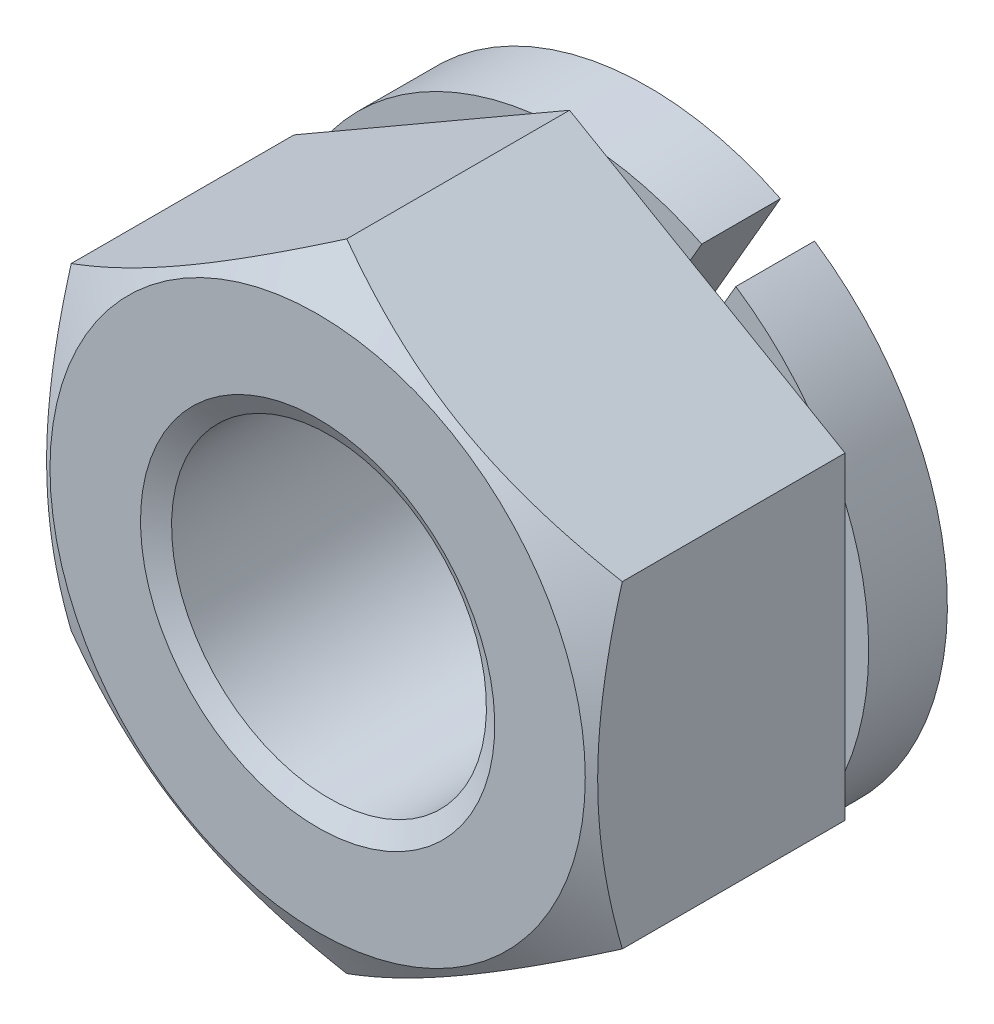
ISO-10303-21;
HEADER;
FILE_DESCRIPTION(('STEP AP214'),'2;1');
FILE_NAME('part.step','',(''),(''),'','','');
FILE_SCHEMA(('AUTOMOTIVE_DESIGN { 1 0 10303 214 1 1 1 1 }'));
ENDSEC;
DATA;
#1=APPLICATION_CONTEXT('core data for automotive mechanical design processes');
#2=APPLICATION_PROTOCOL_DEFINITION('international standard','automotive_design',2000,#1);
#3=PRODUCT_CONTEXT('',#1,'mechanical');
#4=PRODUCT('Part','Part','',(#3));
#5=PRODUCT_RELATED_PRODUCT_CATEGORY('part','',(#4));
#6=PRODUCT_DEFINITION_FORMATION('','',#4);
#7=PRODUCT_DEFINITION_CONTEXT('part definition',#1,'design');
#8=PRODUCT_DEFINITION('design','',#6,#7);
#9=PRODUCT_DEFINITION_SHAPE('','',#8);
#10=(LENGTH_UNIT() NAMED_UNIT(*) SI_UNIT(.MILLI.,.METRE.));
#11=(NAMED_UNIT(*) PLANE_ANGLE_UNIT() SI_UNIT($,.RADIAN.));
#12=(NAMED_UNIT(*) SI_UNIT($,.STERADIAN.) SOLID_ANGLE_UNIT());
#13=UNCERTAINTY_MEASURE_WITH_UNIT(LENGTH_MEASURE(1.E-05),#10,'distance_accuracy_value','');
#14=(GEOMETRIC_REPRESENTATION_CONTEXT(3) GLOBAL_UNCERTAINTY_ASSIGNED_CONTEXT((#13)) GLOBAL_UNIT_ASSIGNED_CONTEXT((#10,
#11,#12)) REPRESENTATION_CONTEXT('',''));
#15=CARTESIAN_POINT('',(0.,0.,0.));
#16=DIRECTION('',(0.,0.,1.));
#17=DIRECTION('',(1.,0.,0.));
#18=AXIS2_PLACEMENT_3D('',#15,#16,#17);
#19=CARTESIAN_POINT('',(7.,0.,1.));
#20=DIRECTION('',(0.,0.,1.));
#21=DIRECTION('',(-0.866025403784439,0.5,0.));
#22=AXIS2_PLACEMENT_3D('',#19,#20,#21);
#23=PLANE('',#22);
#24=CARTESIAN_POINT('',(0.,0.,1.));
#25=DIRECTION('',(0.,0.,-1.));
#26=DIRECTION('',(-0.866025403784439,0.5,0.));
#27=AXIS2_PLACEMENT_3D('',#24,#25,#26);
#28=CIRCLE('',#27,3.8);
#29=CARTESIAN_POINT('',(3.03160056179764,2.2911564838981,1.));
#30=VERTEX_POINT('',#29);
#31=CARTESIAN_POINT('',(3.5,1.47986485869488,1.));
#32=VERTEX_POINT('',#31);
#33=EDGE_CURVE('E9',#30,#32,#28,.T.);
#34=ORIENTED_EDGE('',*,*,#33,.F.);
#35=DIRECTION('',(-0.866025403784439,0.5,0.));
#36=VECTOR('',#35,1.);
#37=CARTESIAN_POINT('',(3.5,2.02072594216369,1.));
#38=LINE('',#37,#36);
#39=CARTESIAN_POINT('',(3.5,2.02072594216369,1.));
#40=VERTEX_POINT('',#39);
#41=EDGE_CURVE('E344',#40,#30,#38,.T.);
#42=ORIENTED_EDGE('',*,*,#41,.F.);
#43=DIRECTION('',(0.,1.,0.));
#44=VECTOR('',#43,1.);
#45=CARTESIAN_POINT('',(3.5,-2.02072594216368,1.));
#46=LINE('',#45,#44);
#47=EDGE_CURVE('E339',#32,#40,#46,.T.);
#48=ORIENTED_EDGE('',*,*,#47,.F.);
#49=EDGE_LOOP('',(#34,#42,#48));
#50=FACE_BOUND('',#49,.T.);
#51=ADVANCED_FACE('F14',(#50),#23,.F.);
#52=CARTESIAN_POINT('',(3.5,-1.47986485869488,1.));
#53=VERTEX_POINT('',#52);
#54=CARTESIAN_POINT('',(3.03160056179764,-2.29115648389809,1.));
#55=VERTEX_POINT('',#54);
#56=EDGE_CURVE('E24',#53,#55,#28,.T.);
#57=ORIENTED_EDGE('',*,*,#56,.F.);
#58=CARTESIAN_POINT('',(3.5,-2.02072594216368,1.));
#59=VERTEX_POINT('',#58);
#60=EDGE_CURVE('E341',#59,#53,#46,.T.);
#61=ORIENTED_EDGE('',*,*,#60,.F.);
#62=DIRECTION('',(0.866025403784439,0.5,0.));
#63=VECTOR('',#62,1.);
#64=CARTESIAN_POINT('',(0.,-4.04145188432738,1.));
#65=LINE('',#64,#63);
#66=EDGE_CURVE('E333',#55,#59,#65,.T.);
#67=ORIENTED_EDGE('',*,*,#66,.F.);
#68=EDGE_LOOP('',(#57,#61,#67));
#69=FACE_BOUND('',#68,.T.);
#70=ADVANCED_FACE('F291',(#69),#23,.F.);
#71=CARTESIAN_POINT('',(0.468399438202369,-3.77102134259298,1.));
#72=VERTEX_POINT('',#71);
#73=CARTESIAN_POINT('',(-0.468399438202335,-3.77102134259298,1.));
#74=VERTEX_POINT('',#73);
#75=EDGE_CURVE('E434',#72,#74,#28,.T.);
#76=ORIENTED_EDGE('',*,*,#75,.F.);
#77=CARTESIAN_POINT('',(0.,-4.04145188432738,1.));
#78=VERTEX_POINT('',#77);
#79=EDGE_CURVE('E336',#78,#72,#65,.T.);
#80=ORIENTED_EDGE('',*,*,#79,.F.);
#81=DIRECTION('',(0.86602540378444,-0.5,0.));
#82=VECTOR('',#81,1.);
#83=CARTESIAN_POINT('',(-3.5,-2.02072594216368,1.));
#84=LINE('',#83,#82);
#85=EDGE_CURVE('E357',#74,#78,#84,.T.);
#86=ORIENTED_EDGE('',*,*,#85,.F.);
#87=EDGE_LOOP('',(#76,#80,#86));
#88=FACE_BOUND('',#87,.T.);
#89=ADVANCED_FACE('F418',(#88),#23,.F.);
#90=CARTESIAN_POINT('',(-3.03160056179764,-2.29115648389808,1.));
#91=VERTEX_POINT('',#90);
#92=CARTESIAN_POINT('',(-3.5,-1.4798648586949,1.));
#93=VERTEX_POINT('',#92);
#94=EDGE_CURVE('E438',#91,#93,#28,.T.);
#95=ORIENTED_EDGE('',*,*,#94,.F.);
#96=CARTESIAN_POINT('',(-3.5,-2.02072594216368,1.));
#97=VERTEX_POINT('',#96);
#98=EDGE_CURVE('E359',#97,#91,#84,.T.);
#99=ORIENTED_EDGE('',*,*,#98,.F.);
#100=DIRECTION('',(0.,-1.,0.));
#101=VECTOR('',#100,1.);
#102=CARTESIAN_POINT('',(-3.5,2.02072594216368,1.));
#103=LINE('',#102,#101);
#104=EDGE_CURVE('E352',#93,#97,#103,.T.);
#105=ORIENTED_EDGE('',*,*,#104,.F.);
#106=EDGE_LOOP('',(#95,#99,#105));
#107=FACE_BOUND('',#106,.T.);
#108=ADVANCED_FACE('F423',(#107),#23,.F.);
#109=CARTESIAN_POINT('',(-3.5,1.47986485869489,1.));
#110=VERTEX_POINT('',#109);
#111=CARTESIAN_POINT('',(-3.03160056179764,2.29115648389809,1.));
#112=VERTEX_POINT('',#111);
#113=EDGE_CURVE('E450',#110,#112,#28,.T.);
#114=ORIENTED_EDGE('',*,*,#113,.F.);
#115=CARTESIAN_POINT('',(-3.5,2.02072594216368,1.));
#116=VERTEX_POINT('',#115);
#117=EDGE_CURVE('E354',#116,#110,#103,.T.);
#118=ORIENTED_EDGE('',*,*,#117,.F.);
#119=DIRECTION('',(-0.866025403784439,-0.5,0.));
#120=VECTOR('',#119,1.);
#121=CARTESIAN_POINT('',(0.,4.04145188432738,1.));
#122=LINE('',#121,#120);
#123=EDGE_CURVE('E347',#112,#116,#122,.T.);
#124=ORIENTED_EDGE('',*,*,#123,.F.);
#125=EDGE_LOOP('',(#114,#118,#124));
#126=FACE_BOUND('',#125,.T.);
#127=ADVANCED_FACE('F429',(#126),#23,.F.);
#128=CARTESIAN_POINT('',(-0.468399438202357,3.77102134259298,1.));
#129=VERTEX_POINT('',#128);
#130=CARTESIAN_POINT('',(0.468399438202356,3.77102134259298,1.));
#131=VERTEX_POINT('',#130);
#132=EDGE_CURVE('E152',#129,#131,#28,.T.);
#133=ORIENTED_EDGE('',*,*,#132,.F.);
#134=CARTESIAN_POINT('',(0.,4.04145188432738,1.));
#135=VERTEX_POINT('',#134);
#136=EDGE_CURVE('E349',#135,#129,#122,.T.);
#137=ORIENTED_EDGE('',*,*,#136,.F.);
#138=EDGE_CURVE('E343',#131,#135,#38,.T.);
#139=ORIENTED_EDGE('',*,*,#138,.F.);
#140=EDGE_LOOP('',(#133,#137,#139));
#141=FACE_BOUND('',#140,.T.);
#142=ADVANCED_FACE('F458',(#141),#23,.F.);
#143=DIRECTION('',(0.5,0.866025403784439,0.));
#144=VECTOR('',#143,1.);
#145=CARTESIAN_POINT('',(1.2338558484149,1.63710101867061,1.));
#146=LINE('',#145,#144);
#147=CARTESIAN_POINT('',(1.334540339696,1.81149167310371,1.));
#148=VERTEX_POINT('',#147);
#149=CARTESIAN_POINT('',(1.96650635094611,2.90608891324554,1.));
#150=VERTEX_POINT('',#149);
#151=EDGE_CURVE('E317',#148,#150,#146,.T.);
#152=ORIENTED_EDGE('',*,*,#151,.F.);
#153=CARTESIAN_POINT('',(0.,0.,1.));
#154=DIRECTION('',(0.,0.,1.));
#155=DIRECTION('',(-0.866025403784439,0.5,0.));
#156=AXIS2_PLACEMENT_3D('',#153,#154,#155);
#157=CIRCLE('',#156,2.25);
#158=CARTESIAN_POINT('',(0.901527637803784,2.06149167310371,1.));
#159=VERTEX_POINT('',#158);
#160=EDGE_CURVE('E328',#148,#159,#157,.T.);
#161=ORIENTED_EDGE('',*,*,#160,.T.);
#162=DIRECTION('',(-0.5,-0.866025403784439,0.));
#163=VECTOR('',#162,1.);
#164=CARTESIAN_POINT('',(0.800843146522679,1.88710101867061,1.));
#165=LINE('',#164,#163);
#166=CARTESIAN_POINT('',(1.53349364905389,3.15608891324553,1.));
#167=VERTEX_POINT('',#166);
#168=EDGE_CURVE('E168',#167,#159,#165,.T.);
#169=ORIENTED_EDGE('',*,*,#168,.F.);
#170=EDGE_CURVE('E483',#150,#167,#38,.T.);
#171=ORIENTED_EDGE('',*,*,#170,.F.);
#172=EDGE_LOOP('',(#152,#161,#169,#171));
#173=FACE_BOUND('',#172,.T.);
#174=ADVANCED_FACE('F255',(#173),#23,.F.);
#175=CARTESIAN_POINT('',(0.,-4.04145188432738,4.2));
#176=DIRECTION('',(-0.5,0.866025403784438,0.));
#177=DIRECTION('',(-0.866025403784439,-0.5,0.));
#178=AXIS2_PLACEMENT_3D('',#175,#176,#177);
#179=PLANE('',#178);
#180=CARTESIAN_POINT('',(-0.000199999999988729,-4.04156735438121,3.82959091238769));
#181=CARTESIAN_POINT('',(0.153607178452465,-3.95276673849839,3.88087918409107));
#182=CARTESIAN_POINT('',(0.30874201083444,-3.86319960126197,3.92752401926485));
#183=CARTESIAN_POINT('',(0.621698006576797,-3.68251437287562,4.00894309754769));
#184=CARTESIAN_POINT('',(0.77952473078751,-3.59139307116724,4.04368853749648));
#185=CARTESIAN_POINT('',(1.09322221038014,-3.41027974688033,4.0977749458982));
#186=CARTESIAN_POINT('',(1.24904469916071,-3.32031559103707,4.11747588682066));
#187=CARTESIAN_POINT('',(1.56142288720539,-3.13996396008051,4.14099484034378));
#188=CARTESIAN_POINT('',(1.71797745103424,-3.04957714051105,4.14483232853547));
#189=CARTESIAN_POINT('',(2.010509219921,-2.88068384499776,4.13684967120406));
#190=CARTESIAN_POINT('',(2.14653021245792,-2.80215208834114,4.12698953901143));
#191=CARTESIAN_POINT('',(2.41768602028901,-2.64560020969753,4.09573850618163));
#192=CARTESIAN_POINT('',(2.55281989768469,-2.56758062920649,4.07433692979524));
#193=CARTESIAN_POINT('',(2.82453479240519,-2.41070596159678,4.02083456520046));
#194=CARTESIAN_POINT('',(2.96108141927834,-2.33187072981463,3.98850697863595));
#195=CARTESIAN_POINT('',(3.2321380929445,-2.17537608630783,3.91513603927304));
#196=CARTESIAN_POINT('',(3.36665161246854,-2.09771466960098,3.87410992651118));
#197=CARTESIAN_POINT('',(3.5002,-2.02061047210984,3.82959091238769));
#198=B_SPLINE_CURVE_WITH_KNOTS('',3,(#180,#181,#182,#183,#184,#185,#186,#187,#188,#189,#190,
#191,#192,#193,#194,#195,#196,#197),.UNSPECIFIED.,.F.,.F.,(4,2,2,2,2,2,2,2,4),(0.,
0.554793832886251,1.11092123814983,1.65328467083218,2.19498204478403,2.66665130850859,
3.13875761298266,3.62133612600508,4.10296698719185),.UNSPECIFIED.);
#199=CARTESIAN_POINT('',(1.30212680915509E-13,-4.04145188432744,3.82965758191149));
#200=VERTEX_POINT('',#199);
#201=CARTESIAN_POINT('',(3.5,-2.02072594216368,3.82965758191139));
#202=VERTEX_POINT('',#201);
#203=EDGE_CURVE('E239',#200,#202,#198,.T.);
#204=ORIENTED_EDGE('',*,*,#203,.F.);
#205=DIRECTION('',(0.,0.,-1.));
#206=VECTOR('',#205,1.);
#207=CARTESIAN_POINT('',(0.,-4.04145188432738,4.2));
#208=LINE('',#207,#206);
#209=EDGE_CURVE('E362',#200,#78,#208,.T.);
#210=ORIENTED_EDGE('',*,*,#209,.T.);
#211=ORIENTED_EDGE('',*,*,#79,.T.);
#212=EDGE_CURVE('E340',#72,#55,#65,.T.);
#213=ORIENTED_EDGE('',*,*,#212,.T.);
#214=ORIENTED_EDGE('',*,*,#66,.T.);
#215=DIRECTION('',(0.,0.,-1.));
#216=VECTOR('',#215,1.);
#217=CARTESIAN_POINT('',(3.5,-2.02072594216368,4.2));
#218=LINE('',#217,#216);
#219=EDGE_CURVE('E377',#202,#59,#218,.T.);
#220=ORIENTED_EDGE('',*,*,#219,.F.);
#221=EDGE_LOOP('',(#204,#210,#211,#213,#214,#220));
#222=FACE_BOUND('',#221,.T.);
#223=ADVANCED_FACE('F16',(#222),#179,.F.);
#224=CARTESIAN_POINT('',(3.5,-2.02072594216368,4.2));
#225=DIRECTION('',(-1.,0.,0.));
#226=DIRECTION('',(0.,-1.,0.));
#227=AXIS2_PLACEMENT_3D('',#224,#225,#226);
#228=PLANE('',#227);
#229=CARTESIAN_POINT('',(3.5,-2.02095688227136,3.82959091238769));
#230=CARTESIAN_POINT('',(3.5,-1.84335565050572,3.88087918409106));
#231=CARTESIAN_POINT('',(3.5,-1.66422137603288,3.92752401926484));
#232=CARTESIAN_POINT('',(3.5,-1.30285091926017,4.00894309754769));
#233=CARTESIAN_POINT('',(3.5,-1.12060831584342,4.04368853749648));
#234=CARTESIAN_POINT('',(3.5,-0.758381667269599,4.0977749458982));
#235=CARTESIAN_POINT('',(3.5,-0.578453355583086,4.11747588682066));
#236=CARTESIAN_POINT('',(3.5,-0.217750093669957,4.14099484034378));
#237=CARTESIAN_POINT('',(3.5,-0.0369764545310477,4.14483232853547));
#238=CARTESIAN_POINT('',(3.5,0.300810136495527,4.13684967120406));
#239=CARTESIAN_POINT('',(3.5,0.457873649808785,4.12698953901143));
#240=CARTESIAN_POINT('',(3.5,0.770977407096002,4.09573850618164));
#241=CARTESIAN_POINT('',(3.5,0.927016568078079,4.07433692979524));
#242=CARTESIAN_POINT('',(3.5,1.2407659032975,4.02083456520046));
#243=CARTESIAN_POINT('',(3.5,1.3984363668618,3.98850697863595));
#244=CARTESIAN_POINT('',(3.5,1.71142565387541,3.91513603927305));
#245=CARTESIAN_POINT('',(3.5,1.8667484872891,3.87410992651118));
#246=CARTESIAN_POINT('',(3.5,2.02095688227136,3.82959091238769));
#247=B_SPLINE_CURVE_WITH_KNOTS('',3,(#229,#230,#231,#232,#233,#234,#235,#236,#237,#238,#239,
#240,#241,#242,#243,#244,#245,#246),.UNSPECIFIED.,.F.,.F.,(4,2,2,2,2,2,2,2,4),(0.,
0.554793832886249,1.11092123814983,1.65328467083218,2.19498204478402,2.66665130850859,
3.13875761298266,3.62133612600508,4.10296698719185),.UNSPECIFIED.);
#248=CARTESIAN_POINT('',(3.50000000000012,2.02072594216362,3.82965758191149));
#249=VERTEX_POINT('',#248);
#250=EDGE_CURVE('E233',#202,#249,#247,.T.);
#251=ORIENTED_EDGE('',*,*,#250,.F.);
#252=ORIENTED_EDGE('',*,*,#219,.T.);
#253=ORIENTED_EDGE('',*,*,#60,.T.);
#254=EDGE_CURVE('E33',#53,#32,#46,.T.);
#255=ORIENTED_EDGE('',*,*,#254,.T.);
#256=ORIENTED_EDGE('',*,*,#47,.T.);
#257=DIRECTION('',(0.,0.,-1.));
#258=VECTOR('',#257,1.);
#259=CARTESIAN_POINT('',(3.5,2.02072594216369,4.2));
#260=LINE('',#259,#258);
#261=EDGE_CURVE('E375',#249,#40,#260,.T.);
#262=ORIENTED_EDGE('',*,*,#261,.F.);
#263=EDGE_LOOP('',(#251,#252,#253,#255,#256,#262));
#264=FACE_BOUND('',#263,.T.);
#265=ADVANCED_FACE('F245',(#264),#228,.F.);
#266=CARTESIAN_POINT('',(3.5,2.02072594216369,4.2));
#267=DIRECTION('',(-0.5,-0.866025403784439,0.));
#268=DIRECTION('',(0.866025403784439,-0.5,0.));
#269=AXIS2_PLACEMENT_3D('',#266,#267,#268);
#270=PLANE('',#269);
#271=CARTESIAN_POINT('',(6.53351075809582,0.269327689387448,2.387663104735));
#272=CARTESIAN_POINT('',(6.40038763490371,0.34618636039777,2.46260923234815));
#273=CARTESIAN_POINT('',(6.26696763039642,0.423216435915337,2.53686380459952));
#274=CARTESIAN_POINT('',(5.99937624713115,0.577710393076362,2.68360264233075));
#275=CARTESIAN_POINT('',(5.86520476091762,0.65517433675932,2.75608664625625));
#276=CARTESIAN_POINT('',(5.59530061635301,0.81100356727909,2.89924151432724));
#277=CARTESIAN_POINT('',(5.45956347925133,0.889371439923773,2.96990115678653));
#278=CARTESIAN_POINT('',(5.18703796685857,1.04671411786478,3.10845313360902));
#279=CARTESIAN_POINT('',(5.05024963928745,1.12568889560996,3.17634559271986));
#280=CARTESIAN_POINT('',(4.77072110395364,1.28707477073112,3.31088978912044));
#281=CARTESIAN_POINT('',(4.62793693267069,1.36951125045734,3.37742038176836));
#282=CARTESIAN_POINT('',(4.34072902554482,1.53533081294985,3.50567384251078));
#283=CARTESIAN_POINT('',(4.19630511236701,1.61871399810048,3.5673961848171));
#284=CARTESIAN_POINT('',(3.90583236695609,1.78641851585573,3.68448279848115));
#285=CARTESIAN_POINT('',(3.75978722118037,1.87073772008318,3.73985914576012));
#286=CARTESIAN_POINT('',(3.46560358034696,2.04058472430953,3.84254051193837));
#287=CARTESIAN_POINT('',(3.31746573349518,2.12611215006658,3.88984797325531));
#288=CARTESIAN_POINT('',(3.01983185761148,2.29795114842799,3.97393426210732));
#289=CARTESIAN_POINT('',(2.87034859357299,2.38425535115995,4.01077225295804));
#290=CARTESIAN_POINT('',(2.56943964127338,2.5579852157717,4.07189963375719));
#291=CARTESIAN_POINT('',(2.41801416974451,2.64541075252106,4.09619041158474));
#292=CARTESIAN_POINT('',(2.11598769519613,2.81978581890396,4.12997273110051));
#293=CARTESIAN_POINT('',(1.96540369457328,2.90672553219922,4.13966193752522));
#294=CARTESIAN_POINT('',(1.66405794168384,3.08070758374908,4.14394653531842));
#295=CARTESIAN_POINT('',(1.513296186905,3.16774992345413,4.13854171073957));
#296=CARTESIAN_POINT('',(1.25977604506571,3.31411984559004,4.11715224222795));
#297=CARTESIAN_POINT('',(1.15675792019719,3.3735973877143,4.10500718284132));
#298=CARTESIAN_POINT('',(0.951426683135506,3.4921454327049,4.07437496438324));
#299=CARTESIAN_POINT('',(0.849113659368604,3.55121588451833,4.0558870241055));
#300=CARTESIAN_POINT('',(0.543399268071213,3.72772017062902,3.99187488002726));
#301=CARTESIAN_POINT('',(0.341321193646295,3.84439000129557,3.9378118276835));
#302=CARTESIAN_POINT('',(0.0389726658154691,4.01895100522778,3.84332389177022));
#303=CARTESIAN_POINT('',(-0.0628461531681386,4.07773612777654,3.80912250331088));
#304=CARTESIAN_POINT('',(-0.265496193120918,4.19473618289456,3.73698461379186));
#305=CARTESIAN_POINT('',(-0.366327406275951,4.25295111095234,3.69904808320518));
#306=CARTESIAN_POINT('',(-0.567032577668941,4.36882829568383,3.62006376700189));
#307=CARTESIAN_POINT('',(-0.666906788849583,4.42649069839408,3.57901683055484));
#308=CARTESIAN_POINT('',(-0.865815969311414,4.541330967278,3.49431282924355));
#309=CARTESIAN_POINT('',(-0.964850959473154,4.59850884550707,3.45065582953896));
#310=CARTESIAN_POINT('',(-1.23682939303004,4.7555356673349,3.32730840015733));
#311=CARTESIAN_POINT('',(-1.4089995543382,4.8549381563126,3.24534643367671));
#312=CARTESIAN_POINT('',(-1.75151600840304,5.05269012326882,3.07647137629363));
#313=CARTESIAN_POINT('',(-1.92186207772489,5.15103947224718,2.98955768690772));
#314=CARTESIAN_POINT('',(-2.26115515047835,5.34693041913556,2.81198278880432));
#315=CARTESIAN_POINT('',(-2.4301016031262,5.44447169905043,2.72132018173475));
#316=CARTESIAN_POINT('',(-2.76683271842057,5.63888349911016,2.53715645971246));
#317=CARTESIAN_POINT('',(-2.93461734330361,5.73575399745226,2.44365525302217));
#318=CARTESIAN_POINT('',(-3.26952869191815,5.92911515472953,2.25429493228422));
#319=CARTESIAN_POINT('',(-3.43665386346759,6.02560491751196,2.15843216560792));
#320=CARTESIAN_POINT('',(-3.77014534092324,6.21814631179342,1.96496066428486));
#321=CARTESIAN_POINT('',(-3.93651163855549,6.31419793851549,1.86735191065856));
#322=CARTESIAN_POINT('',(-4.43460825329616,6.60177415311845,1.57249826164));
#323=CARTESIAN_POINT('',(-4.76541742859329,6.79276691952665,1.37317964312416));
#324=CARTESIAN_POINT('',(-5.38922471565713,7.15292222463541,0.992904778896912));
#325=CARTESIAN_POINT('',(-5.68239695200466,7.32218529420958,0.812327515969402));
#326=CARTESIAN_POINT('',(-6.26777368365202,7.66015270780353,0.449040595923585));
#327=CARTESIAN_POINT('',(-6.55997811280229,7.82885701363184,0.266330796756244));
#328=CARTESIAN_POINT('',(-7.14262338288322,8.16524741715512,-0.100018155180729));
#329=CARTESIAN_POINT('',(-7.43306681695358,8.33293501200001,-0.283651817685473));
#330=CARTESIAN_POINT('',(-8.01335050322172,8.66796195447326,-0.652119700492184));
#331=CARTESIAN_POINT('',(-8.30319080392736,8.83530133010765,-0.836953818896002));
#332=CARTESIAN_POINT('',(-8.59282080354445,9.00251928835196,-1.0222236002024));
#333=B_SPLINE_CURVE_WITH_KNOTS('',3,(#271,#272,#273,#274,#275,#276,#277,#278,#279,#280,#281,
#282,#283,#284,#285,#286,#287,#288,#289,#290,#291,#292,#293,#294,#295,#296,#297,#298,#299,#300,
#301,#302,#303,#304,#305,#306,#307,#308,#309,#310,#311,#312,#313,#314,#315,#316,#317,#318,#319,
#320,#321,#322,#323,#324,#325,#326,#327,#328,#329,#330,#331,#332),.UNSPECIFIED.,.F.,.F.,(4,2,2,
2,2,2,2,2,2,2,2,2,2,2,2,2,2,2,2,2,2,2,2,2,2,2,2,2,2,2,4),(0.,0.513049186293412,1.02617370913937,
1.54193311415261,2.05766924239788,2.59098230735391,3.12435360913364,3.65669247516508,
4.1888699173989,4.71797733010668,5.24702620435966,5.76884678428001,6.29067482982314,
6.64922317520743,7.00781569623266,7.72534195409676,8.09263967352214,8.45994029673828,
8.8271410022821,9.19433254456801,9.83934350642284,10.484432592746,11.1297645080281,
11.7751173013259,12.4215401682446,13.067970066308,14.3605163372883,15.5115399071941,
16.6626405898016,17.8097127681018,18.9566888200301),.UNSPECIFIED.);
#334=CARTESIAN_POINT('',(0.,4.04145188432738,3.82965758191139));
#335=VERTEX_POINT('',#334);
#336=EDGE_CURVE('E227',#249,#335,#333,.T.);
#337=ORIENTED_EDGE('',*,*,#336,.F.);
#338=ORIENTED_EDGE('',*,*,#261,.T.);
#339=ORIENTED_EDGE('',*,*,#41,.T.);
#340=EDGE_CURVE('E348',#30,#150,#38,.T.);
#341=ORIENTED_EDGE('',*,*,#340,.T.);
#342=ORIENTED_EDGE('',*,*,#170,.T.);
#343=EDGE_CURVE('E161',#167,#131,#38,.T.);
#344=ORIENTED_EDGE('',*,*,#343,.T.);
#345=ORIENTED_EDGE('',*,*,#138,.T.);
#346=DIRECTION('',(0.,0.,-1.));
#347=VECTOR('',#346,1.);
#348=CARTESIAN_POINT('',(0.,4.04145188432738,4.2));
#349=LINE('',#348,#347);
#350=EDGE_CURVE('E372',#335,#135,#349,.T.);
#351=ORIENTED_EDGE('',*,*,#350,.F.);
#352=EDGE_LOOP('',(#337,#338,#339,#341,#342,#344,#345,#351));
#353=FACE_BOUND('',#352,.T.);
#354=ADVANCED_FACE('F218',(#353),#270,.F.);
#355=CARTESIAN_POINT('',(0.,4.04145188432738,4.2));
#356=DIRECTION('',(0.5,-0.866025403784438,0.));
#357=DIRECTION('',(0.866025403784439,0.5,0.));
#358=AXIS2_PLACEMENT_3D('',#355,#356,#357);
#359=PLANE('',#358);
#360=CARTESIAN_POINT('',(0.000200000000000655,4.04156735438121,3.82959091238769));
#361=CARTESIAN_POINT('',(-0.153607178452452,3.95276673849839,3.88087918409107));
#362=CARTESIAN_POINT('',(-0.308742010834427,3.86319960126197,3.92752401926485));
#363=CARTESIAN_POINT('',(-0.621698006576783,3.68251437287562,4.00894309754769));
#364=CARTESIAN_POINT('',(-0.779524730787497,3.59139307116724,4.04368853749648));
#365=CARTESIAN_POINT('',(-1.09322221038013,3.41027974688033,4.0977749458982));
#366=CARTESIAN_POINT('',(-1.24904469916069,3.32031559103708,4.11747588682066));
#367=CARTESIAN_POINT('',(-1.56142288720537,3.13996396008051,4.14099484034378));
#368=CARTESIAN_POINT('',(-1.71797745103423,3.04957714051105,4.14483232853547));
#369=CARTESIAN_POINT('',(-2.01050921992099,2.88068384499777,4.13684967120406));
#370=CARTESIAN_POINT('',(-2.1465302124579,2.80215208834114,4.12698953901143));
#371=CARTESIAN_POINT('',(-2.41768602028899,2.64560020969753,4.09573850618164));
#372=CARTESIAN_POINT('',(-2.55281989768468,2.56758062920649,4.07433692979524));
#373=CARTESIAN_POINT('',(-2.82453479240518,2.41070596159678,4.02083456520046));
#374=CARTESIAN_POINT('',(-2.96108141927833,2.33187072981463,3.98850697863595));
#375=CARTESIAN_POINT('',(-3.2321380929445,2.17537608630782,3.91513603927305));
#376=CARTESIAN_POINT('',(-3.36665161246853,2.09771466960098,3.87410992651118));
#377=CARTESIAN_POINT('',(-3.5002,2.02061047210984,3.82959091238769));
#378=B_SPLINE_CURVE_WITH_KNOTS('',3,(#360,#361,#362,#363,#364,#365,#366,#367,#368,#369,#370,
#371,#372,#373,#374,#375,#376,#377),.UNSPECIFIED.,.F.,.F.,(4,2,2,2,2,2,2,2,4),(0.,
0.55479383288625,1.11092123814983,1.65328467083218,2.19498204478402,2.66665130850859,
3.13875761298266,3.62133612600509,4.10296698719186),.UNSPECIFIED.);
#379=CARTESIAN_POINT('',(-3.5,2.02072594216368,3.82965758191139));
#380=VERTEX_POINT('',#379);
#381=EDGE_CURVE('E221',#335,#380,#378,.T.);
#382=ORIENTED_EDGE('',*,*,#381,.F.);
#383=ORIENTED_EDGE('',*,*,#350,.T.);
#384=ORIENTED_EDGE('',*,*,#136,.T.);
#385=EDGE_CURVE('E353',#129,#112,#122,.T.);
#386=ORIENTED_EDGE('',*,*,#385,.T.);
#387=ORIENTED_EDGE('',*,*,#123,.T.);
#388=DIRECTION('',(0.,0.,-1.));
#389=VECTOR('',#388,1.);
#390=CARTESIAN_POINT('',(-3.5,2.02072594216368,4.2));
#391=LINE('',#390,#389);
#392=EDGE_CURVE('E369',#380,#116,#391,.T.);
#393=ORIENTED_EDGE('',*,*,#392,.F.);
#394=EDGE_LOOP('',(#382,#383,#384,#386,#387,#393));
#395=FACE_BOUND('',#394,.T.);
#396=ADVANCED_FACE('F213',(#395),#359,.F.);
#397=CARTESIAN_POINT('',(-3.5,2.02072594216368,4.2));
#398=DIRECTION('',(1.,0.,0.));
#399=DIRECTION('',(0.,1.,0.));
#400=AXIS2_PLACEMENT_3D('',#397,#398,#399);
#401=PLANE('',#400);
#402=CARTESIAN_POINT('',(-3.5,2.02095688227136,3.82959091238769));
#403=CARTESIAN_POINT('',(-3.5,1.84335565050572,3.88087918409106));
#404=CARTESIAN_POINT('',(-3.5,1.66422137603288,3.92752401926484));
#405=CARTESIAN_POINT('',(-3.5,1.30285091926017,4.00894309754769));
#406=CARTESIAN_POINT('',(-3.5,1.12060831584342,4.04368853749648));
#407=CARTESIAN_POINT('',(-3.5,0.758381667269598,4.0977749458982));
#408=CARTESIAN_POINT('',(-3.5,0.578453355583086,4.11747588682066));
#409=CARTESIAN_POINT('',(-3.5,0.217750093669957,4.14099484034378));
#410=CARTESIAN_POINT('',(-3.5,0.0369764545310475,4.14483232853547));
#411=CARTESIAN_POINT('',(-3.5,-0.300810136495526,4.13684967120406));
#412=CARTESIAN_POINT('',(-3.5,-0.457873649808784,4.12698953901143));
#413=CARTESIAN_POINT('',(-3.5,-0.770977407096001,4.09573850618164));
#414=CARTESIAN_POINT('',(-3.5,-0.927016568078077,4.07433692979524));
#415=CARTESIAN_POINT('',(-3.5,-1.2407659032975,4.02083456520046));
#416=CARTESIAN_POINT('',(-3.5,-1.3984363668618,3.98850697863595));
#417=CARTESIAN_POINT('',(-3.5,-1.71142565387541,3.91513603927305));
#418=CARTESIAN_POINT('',(-3.5,-1.8667484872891,3.87410992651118));
#419=CARTESIAN_POINT('',(-3.5,-2.02095688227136,3.82959091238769));
#420=B_SPLINE_CURVE_WITH_KNOTS('',3,(#402,#403,#404,#405,#406,#407,#408,#409,#410,#411,#412,
#413,#414,#415,#416,#417,#418,#419),.UNSPECIFIED.,.F.,.F.,(4,2,2,2,2,2,2,2,4),(0.,
0.55479383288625,1.11092123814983,1.65328467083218,2.19498204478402,2.66665130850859,
3.13875761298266,3.62133612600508,4.10296698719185),.UNSPECIFIED.);
#421=CARTESIAN_POINT('',(-3.5,-2.02072594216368,3.82965758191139));
#422=VERTEX_POINT('',#421);
#423=EDGE_CURVE('E191',#380,#422,#420,.T.);
#424=ORIENTED_EDGE('',*,*,#423,.F.);
#425=ORIENTED_EDGE('',*,*,#392,.T.);
#426=ORIENTED_EDGE('',*,*,#117,.T.);
#427=EDGE_CURVE('E358',#110,#93,#103,.T.);
#428=ORIENTED_EDGE('',*,*,#427,.T.);
#429=ORIENTED_EDGE('',*,*,#104,.T.);
#430=DIRECTION('',(0.,0.,-1.));
#431=VECTOR('',#430,1.);
#432=CARTESIAN_POINT('',(-3.5,-2.02072594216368,4.2));
#433=LINE('',#432,#431);
#434=EDGE_CURVE('E366',#422,#97,#433,.T.);
#435=ORIENTED_EDGE('',*,*,#434,.F.);
#436=EDGE_LOOP('',(#424,#425,#426,#428,#429,#435));
#437=FACE_BOUND('',#436,.T.);
#438=ADVANCED_FACE('F207',(#437),#401,.F.);
#439=CARTESIAN_POINT('',(-3.5,-2.02072594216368,4.2));
#440=DIRECTION('',(0.5,0.866025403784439,0.));
#441=DIRECTION('',(-0.86602540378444,0.5,0.));
#442=AXIS2_PLACEMENT_3D('',#439,#440,#441);
#443=PLANE('',#442);
#444=CARTESIAN_POINT('',(3.03351075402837,-5.79285013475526,2.38766310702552));
#445=CARTESIAN_POINT('',(2.90038763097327,-5.71599146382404,2.46260923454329));
#446=CARTESIAN_POINT('',(2.76696762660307,-5.63896138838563,2.53686380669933));
#447=CARTESIAN_POINT('',(2.49937624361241,-5.48446743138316,2.68360264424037));
#448=CARTESIAN_POINT('',(2.36520475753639,-5.40700348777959,2.75608664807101));
#449=CARTESIAN_POINT('',(2.09530061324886,-5.25117425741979,2.89924151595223));
#450=CARTESIAN_POINT('',(1.95956347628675,-5.17280638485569,2.96990115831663));
#451=CARTESIAN_POINT('',(1.68703796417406,-5.01546370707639,3.10845313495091));
#452=CARTESIAN_POINT('',(1.55024963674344,-4.93648892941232,3.17634559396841));
#453=CARTESIAN_POINT('',(1.27072110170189,-4.7751030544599,3.31088979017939));
#454=CARTESIAN_POINT('',(1.12793693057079,-4.69266657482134,3.37742038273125));
#455=CARTESIAN_POINT('',(0.840729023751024,-4.52684701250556,3.50567384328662));
#456=CARTESIAN_POINT('',(0.696305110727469,-4.44346382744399,3.56739618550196));
#457=CARTESIAN_POINT('',(0.405832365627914,-4.27575930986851,3.68448279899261));
#458=CARTESIAN_POINT('',(0.259787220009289,-4.19144010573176,3.73985914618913));
#459=CARTESIAN_POINT('',(-0.0343964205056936,-4.02159310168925,3.84254051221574));
#460=CARTESIAN_POINT('',(-0.18253426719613,-3.93606567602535,3.88984797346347));
#461=CARTESIAN_POINT('',(-0.480168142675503,-3.76422667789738,3.97393426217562));
#462=CARTESIAN_POINT('',(-0.629651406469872,-3.67792247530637,4.01077225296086));
#463=CARTESIAN_POINT('',(-0.93056035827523,-3.50419261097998,4.07189963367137));
#464=CARTESIAN_POINT('',(-1.08198582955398,-3.41676707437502,4.09619041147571));
#465=CARTESIAN_POINT('',(-1.38401230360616,-3.24239200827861,4.12997273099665));
#466=CARTESIAN_POINT('',(-1.53459630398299,-3.15545229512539,4.13966193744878));
#467=CARTESIAN_POINT('',(-1.83594205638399,-2.98147024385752,4.14394653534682));
#468=CARTESIAN_POINT('',(-1.9867038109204,-2.89442790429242,4.1385417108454));
#469=CARTESIAN_POINT('',(-2.24022395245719,-2.74805798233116,4.11715224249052));
#470=CARTESIAN_POINT('',(-2.34324207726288,-2.68858044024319,4.10500718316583));
#471=CARTESIAN_POINT('',(-2.54857331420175,-2.5700323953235,4.07437496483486));
#472=CARTESIAN_POINT('',(-2.65088633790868,-2.5109619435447,4.05588702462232));
#473=CARTESIAN_POINT('',(-2.95660072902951,-2.33445765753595,3.99187488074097));
#474=CARTESIAN_POINT('',(-3.15867880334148,-2.2177878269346,3.93781182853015));
#475=CARTESIAN_POINT('',(-3.46102733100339,-2.04322682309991,3.84332389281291));
#476=CARTESIAN_POINT('',(-3.56284614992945,-1.98444170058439,3.80912250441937));
#477=CARTESIAN_POINT('',(-3.76549618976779,-1.86744164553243,3.73698461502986));
#478=CARTESIAN_POINT('',(-3.86632740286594,-1.8092267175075,3.69904808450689));
#479=CARTESIAN_POINT('',(-4.06703257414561,-1.69334953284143,3.62006376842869));
#480=CARTESIAN_POINT('',(-4.16690678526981,-1.63568713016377,3.57901683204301));
#481=CARTESIAN_POINT('',(-4.36581596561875,-1.52084686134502,3.49431283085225));
#482=CARTESIAN_POINT('',(-4.46485095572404,-1.46366898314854,3.45065583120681));
#483=CARTESIAN_POINT('',(-4.73682938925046,-1.30664216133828,3.32730840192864));
#484=CARTESIAN_POINT('',(-4.90899955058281,-1.20723967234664,3.24534643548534));
#485=CARTESIAN_POINT('',(-5.25151600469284,-1.00948770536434,3.07647137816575));
#486=CARTESIAN_POINT('',(-5.42186207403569,-0.911138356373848,2.98955768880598));
#487=CARTESIAN_POINT('',(-5.76115514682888,-0.715247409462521,2.81198279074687));
#488=CARTESIAN_POINT('',(-5.93010159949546,-0.617706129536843,2.72132018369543));
#489=CARTESIAN_POINT('',(-6.2668327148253,-0.423294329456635,2.53715646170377));
#490=CARTESIAN_POINT('',(-6.43461733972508,-0.326423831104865,2.44365525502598));
#491=CARTESIAN_POINT('',(-6.76952868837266,-0.133062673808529,2.25429493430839));
#492=CARTESIAN_POINT('',(-6.93665385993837,-0.0365729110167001,2.15843216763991));
#493=CARTESIAN_POINT('',(-7.27014533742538,0.155968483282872,1.96496066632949));
#494=CARTESIAN_POINT('',(-7.43651163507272,0.252020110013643,1.86735191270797));
#495=CARTESIAN_POINT('',(-7.93460824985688,0.539596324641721,1.57249826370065));
#496=CARTESIAN_POINT('',(-8.26541742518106,0.73058909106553,1.37317964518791));
#497=CARTESIAN_POINT('',(-8.88922471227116,1.09074439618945,0.992904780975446));
#498=CARTESIAN_POINT('',(-9.18239694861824,1.26000746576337,0.812327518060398));
#499=CARTESIAN_POINT('',(-9.76777368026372,1.59797487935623,0.449040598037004));
#500=CARTESIAN_POINT('',(-10.0599781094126,1.76667918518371,0.266330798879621));
#501=CARTESIAN_POINT('',(-10.642623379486,2.10306958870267,-0.100018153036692));
#502=CARTESIAN_POINT('',(-10.9330668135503,2.27075718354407,-0.283651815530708));
#503=CARTESIAN_POINT('',(-11.5133504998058,2.60578412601,-0.652119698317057));
#504=CARTESIAN_POINT('',(-11.8031908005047,2.77312350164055,-0.83695381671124));
#505=CARTESIAN_POINT('',(-12.092820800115,2.94034145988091,-1.02222359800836));
#506=B_SPLINE_CURVE_WITH_KNOTS('',3,(#444,#445,#446,#447,#448,#449,#450,#451,#452,#453,#454,
#455,#456,#457,#458,#459,#460,#461,#462,#463,#464,#465,#466,#467,#468,#469,#470,#471,#472,#473,
#474,#475,#476,#477,#478,#479,#480,#481,#482,#483,#484,#485,#486,#487,#488,#489,#490,#491,#492,
#493,#494,#495,#496,#497,#498,#499,#500,#501,#502,#503,#504,#505),.UNSPECIFIED.,.F.,.F.,(4,2,2,
2,2,2,2,2,2,2,2,2,2,2,2,2,2,2,2,2,2,2,2,2,2,2,2,2,2,2,4),(0.,0.513049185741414,1.0261737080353,
1.54193311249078,2.05766924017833,2.59098230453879,3.12435360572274,3.65669247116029,
4.18886991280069,4.71797732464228,5.24702619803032,5.76884677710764,6.29067482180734,
6.64922316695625,7.00781568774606,7.72534194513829,8.09263966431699,8.45994028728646,
8.82714099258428,9.19433253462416,9.83934349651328,10.4844325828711,11.129764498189,
11.7751172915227,12.4215401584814,13.0679700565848,14.3605163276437,15.5115398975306,
16.6626405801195,17.8097127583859,18.95668881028),.UNSPECIFIED.);
#507=EDGE_CURVE('E177',#422,#200,#506,.F.);
#508=ORIENTED_EDGE('',*,*,#507,.F.);
#509=ORIENTED_EDGE('',*,*,#434,.T.);
#510=ORIENTED_EDGE('',*,*,#98,.T.);
#511=EDGE_CURVE('E363',#91,#74,#84,.T.);
#512=ORIENTED_EDGE('',*,*,#511,.T.);
#513=ORIENTED_EDGE('',*,*,#85,.T.);
#514=ORIENTED_EDGE('',*,*,#209,.F.);
#515=EDGE_LOOP('',(#508,#509,#510,#512,#513,#514));
#516=FACE_BOUND('',#515,.T.);
#517=ADVANCED_FACE('F202',(#516),#443,.F.);
#518=CARTESIAN_POINT('',(7.,0.,4.2));
#519=DIRECTION('',(0.,0.,1.));
#520=DIRECTION('',(-0.866025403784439,0.5,0.));
#521=AXIS2_PLACEMENT_3D('',#518,#519,#520);
#522=PLANE('',#521);
#523=CARTESIAN_POINT('',(0.,0.,4.2));
#524=DIRECTION('',(0.,0.,1.));
#525=DIRECTION('',(-0.866025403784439,0.5,0.));
#526=AXIS2_PLACEMENT_3D('',#523,#524,#525);
#527=CIRCLE('',#526,2.25);
#528=CARTESIAN_POINT('',(-1.94855715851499,1.125,4.2));
#529=VERTEX_POINT('',#528);
#530=EDGE_CURVE('E331',#529,#529,#527,.T.);
#531=ORIENTED_EDGE('',*,*,#530,.F.);
#532=EDGE_LOOP('',(#531));
#533=FACE_BOUND('',#532,.T.);
#534=CARTESIAN_POINT('',(0.,0.,4.2));
#535=DIRECTION('',(0.,0.,1.));
#536=DIRECTION('',(-0.866025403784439,0.5,0.));
#537=AXIS2_PLACEMENT_3D('',#534,#535,#536);
#538=CIRCLE('',#537,3.4);
#539=CARTESIAN_POINT('',(-2.94448637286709,1.7,4.2));
#540=VERTEX_POINT('',#539);
#541=EDGE_CURVE('E173',#540,#540,#538,.T.);
#542=ORIENTED_EDGE('',*,*,#541,.T.);
#543=EDGE_LOOP('',(#542));
#544=FACE_BOUND('',#543,.T.);
#545=ADVANCED_FACE('F206',(#533,#544),#522,.T.);
#546=CARTESIAN_POINT('',(0.,0.,4.2));
#547=DIRECTION('',(0.,0.,1.));
#548=DIRECTION('',(-0.866025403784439,0.5,0.));
#549=AXIS2_PLACEMENT_3D('',#546,#547,#548);
#550=CONICAL_SURFACE('',#549,2.25,1.0471975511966);
#551=CARTESIAN_POINT('',(0.,0.,4.05566243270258));
#552=DIRECTION('',(0.,0.,1.));
#553=DIRECTION('',(0.866025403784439,-0.5,0.));
#554=AXIS2_PLACEMENT_3D('',#551,#552,#553);
#555=CIRCLE('',#554,2.);
#556=CARTESIAN_POINT('',(1.73205080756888,-1.,4.05566243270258));
#557=VERTEX_POINT('',#556);
#558=EDGE_CURVE('E157',#557,#557,#555,.F.);
#559=ORIENTED_EDGE('',*,*,#558,.T.);
#560=EDGE_LOOP('',(#559));
#561=FACE_BOUND('',#560,.T.);
#562=ORIENTED_EDGE('',*,*,#530,.T.);
#563=EDGE_LOOP('',(#562));
#564=FACE_BOUND('',#563,.T.);
#565=ADVANCED_FACE('F396',(#561,#564),#550,.F.);
#566=CARTESIAN_POINT('',(0.,0.,1.34641016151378));
#567=DIRECTION('',(0.,0.,-1.));
#568=DIRECTION('',(0.866025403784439,-0.5,0.));
#569=AXIS2_PLACEMENT_3D('',#566,#567,#568);
#570=CONICAL_SURFACE('',#569,1.65,1.0471975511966);
#571=CARTESIAN_POINT('',(0.,0.,1.14433756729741));
#572=DIRECTION('',(0.,0.,-1.));
#573=DIRECTION('',(-0.866025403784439,0.5,0.));
#574=AXIS2_PLACEMENT_3D('',#571,#572,#573);
#575=CIRCLE('',#574,2.);
#576=CARTESIAN_POINT('',(-1.73205080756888,1.,1.14433756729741));
#577=VERTEX_POINT('',#576);
#578=EDGE_CURVE('E19',#577,#577,#575,.F.);
#579=ORIENTED_EDGE('',*,*,#578,.T.);
#580=EDGE_LOOP('',(#579));
#581=FACE_BOUND('',#580,.T.);
#582=ORIENTED_EDGE('',*,*,#160,.F.);
#583=EDGE_CURVE('E329',#159,#148,#157,.T.);
#584=ORIENTED_EDGE('',*,*,#583,.F.);
#585=EDGE_LOOP('',(#582,#584));
#586=FACE_BOUND('',#585,.T.);
#587=ADVANCED_FACE('F302',(#581,#586),#570,.F.);
#588=CARTESIAN_POINT('',(0.,0.,4.2));
#589=DIRECTION('',(0.,0.,-1.));
#590=DIRECTION('',(0.866025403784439,-0.5,0.));
#591=AXIS2_PLACEMENT_3D('',#588,#589,#590);
#592=CONICAL_SURFACE('',#591,3.4,1.0471975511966);
#593=ORIENTED_EDGE('',*,*,#541,.F.);
#594=EDGE_LOOP('',(#593));
#595=FACE_BOUND('',#594,.T.);
#596=ORIENTED_EDGE('',*,*,#203,.T.);
#597=ORIENTED_EDGE('',*,*,#250,.T.);
#598=ORIENTED_EDGE('',*,*,#336,.T.);
#599=ORIENTED_EDGE('',*,*,#381,.T.);
#600=ORIENTED_EDGE('',*,*,#423,.T.);
#601=ORIENTED_EDGE('',*,*,#507,.T.);
#602=EDGE_LOOP('',(#596,#597,#598,#599,#600,#601));
#603=FACE_BOUND('',#602,.T.);
#604=ADVANCED_FACE('F198',(#595,#603),#592,.T.);
#605=CARTESIAN_POINT('',(0.,0.,0.));
#606=DIRECTION('',(0.,0.,-1.));
#607=DIRECTION('',(-0.866025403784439,0.5,0.));
#608=AXIS2_PLACEMENT_3D('',#605,#606,#607);
#609=PLANE('',#608);
#610=CARTESIAN_POINT('',(0.,0.,0.));
#611=DIRECTION('',(0.,0.,-1.));
#612=DIRECTION('',(-0.866025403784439,0.5,0.));
#613=AXIS2_PLACEMENT_3D('',#610,#611,#612);
#614=CIRCLE('',#613,3.8);
#615=CARTESIAN_POINT('',(2.11239004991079,3.15876689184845,0.));
#616=VERTEX_POINT('',#615);
#617=CARTESIAN_POINT('',(1.67937734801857,3.40876689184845,0.));
#618=VERTEX_POINT('',#617);
#619=EDGE_CURVE('E323',#616,#618,#614,.T.);
#620=ORIENTED_EDGE('',*,*,#619,.T.);
#621=DIRECTION('',(-0.5,-0.866025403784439,0.));
#622=VECTOR('',#621,1.);
#623=CARTESIAN_POINT('',(0.800843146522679,1.88710101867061,0.));
#624=LINE('',#623,#622);
#625=CARTESIAN_POINT('',(0.800843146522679,1.88710101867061,0.));
#626=VERTEX_POINT('',#625);
#627=EDGE_CURVE('E171',#618,#626,#624,.T.);
#628=ORIENTED_EDGE('',*,*,#627,.T.);
#629=CARTESIAN_POINT('',(0.,0.,0.));
#630=DIRECTION('',(0.,0.,1.));
#631=DIRECTION('',(-0.866025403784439,0.5,0.));
#632=AXIS2_PLACEMENT_3D('',#629,#630,#631);
#633=CIRCLE('',#632,2.05);
#634=CARTESIAN_POINT('',(1.2338558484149,1.63710101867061,0.));
#635=VERTEX_POINT('',#634);
#636=EDGE_CURVE('E490',#626,#635,#633,.T.);
#637=ORIENTED_EDGE('',*,*,#636,.T.);
#638=DIRECTION('',(0.5,0.866025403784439,0.));
#639=VECTOR('',#638,1.);
#640=CARTESIAN_POINT('',(1.2338558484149,1.63710101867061,0.));
#641=LINE('',#640,#639);
#642=EDGE_CURVE('E492',#635,#616,#641,.T.);
#643=ORIENTED_EDGE('',*,*,#642,.T.);
#644=EDGE_LOOP('',(#620,#628,#637,#643));
#645=FACE_BOUND('',#644,.T.);
#646=ADVANCED_FACE('F279',(#645),#609,.T.);
#647=CARTESIAN_POINT('',(0.,0.,0.));
#648=DIRECTION('',(0.,0.,1.));
#649=DIRECTION('',(0.866025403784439,-0.5,0.));
#650=AXIS2_PLACEMENT_3D('',#647,#648,#649);
#651=CYLINDRICAL_SURFACE('',#650,2.05);
#652=CARTESIAN_POINT('',(0.,0.,1.));
#653=DIRECTION('',(0.,0.,1.));
#654=DIRECTION('',(-0.866025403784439,0.5,0.));
#655=AXIS2_PLACEMENT_3D('',#652,#653,#654);
#656=CIRCLE('',#655,2.05);
#657=CARTESIAN_POINT('',(0.800843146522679,1.88710101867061,1.));
#658=VERTEX_POINT('',#657);
#659=CARTESIAN_POINT('',(1.2338558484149,1.63710101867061,1.));
#660=VERTEX_POINT('',#659);
#661=EDGE_CURVE('E165',#658,#660,#656,.T.);
#662=ORIENTED_EDGE('',*,*,#661,.T.);
#663=DIRECTION('',(0.,0.,1.));
#664=VECTOR('',#663,1.);
#665=CARTESIAN_POINT('',(1.2338558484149,1.63710101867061,0.));
#666=LINE('',#665,#664);
#667=EDGE_CURVE('E180',#635,#660,#666,.T.);
#668=ORIENTED_EDGE('',*,*,#667,.F.);
#669=ORIENTED_EDGE('',*,*,#636,.F.);
#670=DIRECTION('',(0.,0.,1.));
#671=VECTOR('',#670,1.);
#672=CARTESIAN_POINT('',(0.800843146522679,1.88710101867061,0.));
#673=LINE('',#672,#671);
#674=EDGE_CURVE('E174',#626,#658,#673,.T.);
#675=ORIENTED_EDGE('',*,*,#674,.T.);
#676=EDGE_LOOP('',(#662,#668,#669,#675));
#677=FACE_BOUND('',#676,.T.);
#678=ADVANCED_FACE('F288',(#677),#651,.F.);
#679=CARTESIAN_POINT('',(0.,0.,1.));
#680=DIRECTION('',(0.,0.,-1.));
#681=DIRECTION('',(-0.866025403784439,0.5,0.));
#682=AXIS2_PLACEMENT_3D('',#679,#680,#681);
#683=PLANE('',#682);
#684=EDGE_CURVE('E166',#159,#658,#165,.T.);
#685=ORIENTED_EDGE('',*,*,#684,.F.);
#686=ORIENTED_EDGE('',*,*,#583,.T.);
#687=EDGE_CURVE('E315',#660,#148,#146,.T.);
#688=ORIENTED_EDGE('',*,*,#687,.F.);
#689=ORIENTED_EDGE('',*,*,#661,.F.);
#690=EDGE_LOOP('',(#685,#686,#688,#689));
#691=FACE_BOUND('',#690,.T.);
#692=ADVANCED_FACE('F278',(#691),#683,.F.);
#693=CARTESIAN_POINT('',(0.800843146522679,1.88710101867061,0.));
#694=DIRECTION('',(-0.866025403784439,0.5,0.));
#695=DIRECTION('',(0.5,0.866025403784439,0.));
#696=AXIS2_PLACEMENT_3D('',#693,#694,#695);
#697=PLANE('',#696);
#698=CARTESIAN_POINT('',(1.67937734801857,3.40876689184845,1.));
#699=VERTEX_POINT('',#698);
#700=EDGE_CURVE('E159',#699,#167,#165,.T.);
#701=ORIENTED_EDGE('',*,*,#700,.T.);
#702=ORIENTED_EDGE('',*,*,#168,.T.);
#703=ORIENTED_EDGE('',*,*,#684,.T.);
#704=ORIENTED_EDGE('',*,*,#674,.F.);
#705=ORIENTED_EDGE('',*,*,#627,.F.);
#706=DIRECTION('',(0.,0.,1.));
#707=VECTOR('',#706,1.);
#708=CARTESIAN_POINT('',(1.67937734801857,3.40876689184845,0.));
#709=LINE('',#708,#707);
#710=EDGE_CURVE('E150',#618,#699,#709,.T.);
#711=ORIENTED_EDGE('',*,*,#710,.T.);
#712=EDGE_LOOP('',(#701,#702,#703,#704,#705,#711));
#713=FACE_BOUND('',#712,.T.);
#714=ADVANCED_FACE('F169',(#713),#697,.F.);
#715=CARTESIAN_POINT('',(1.2338558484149,1.63710101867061,0.));
#716=DIRECTION('',(0.866025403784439,-0.5,0.));
#717=DIRECTION('',(-0.5,-0.866025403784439,0.));
#718=AXIS2_PLACEMENT_3D('',#715,#716,#717);
#719=PLANE('',#718);
#720=ORIENTED_EDGE('',*,*,#687,.T.);
#721=ORIENTED_EDGE('',*,*,#151,.T.);
#722=CARTESIAN_POINT('',(2.11239004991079,3.15876689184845,1.));
#723=VERTEX_POINT('',#722);
#724=EDGE_CURVE('E324',#150,#723,#146,.T.);
#725=ORIENTED_EDGE('',*,*,#724,.T.);
#726=DIRECTION('',(0.,0.,1.));
#727=VECTOR('',#726,1.);
#728=CARTESIAN_POINT('',(2.11239004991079,3.15876689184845,0.));
#729=LINE('',#728,#727);
#730=EDGE_CURVE('E494',#616,#723,#729,.T.);
#731=ORIENTED_EDGE('',*,*,#730,.F.);
#732=ORIENTED_EDGE('',*,*,#642,.F.);
#733=ORIENTED_EDGE('',*,*,#667,.T.);
#734=EDGE_LOOP('',(#720,#721,#725,#731,#732,#733));
#735=FACE_BOUND('',#734,.T.);
#736=ADVANCED_FACE('F286',(#735),#719,.F.);
#737=CARTESIAN_POINT('',(0.,0.,0.));
#738=DIRECTION('',(0.,0.,1.));
#739=DIRECTION('',(0.866025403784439,-0.5,0.));
#740=AXIS2_PLACEMENT_3D('',#737,#738,#739);
#741=CYLINDRICAL_SURFACE('',#740,3.8);
#742=EDGE_CURVE('E26',#723,#30,#28,.T.);
#743=ORIENTED_EDGE('',*,*,#742,.T.);
#744=ORIENTED_EDGE('',*,*,#33,.T.);
#745=EDGE_CURVE('E382',#32,#53,#28,.T.);
#746=ORIENTED_EDGE('',*,*,#745,.T.);
#747=ORIENTED_EDGE('',*,*,#56,.T.);
#748=EDGE_CURVE('E386',#55,#72,#28,.T.);
#749=ORIENTED_EDGE('',*,*,#748,.T.);
#750=ORIENTED_EDGE('',*,*,#75,.T.);
#751=EDGE_CURVE('E440',#74,#91,#28,.T.);
#752=ORIENTED_EDGE('',*,*,#751,.T.);
#753=ORIENTED_EDGE('',*,*,#94,.T.);
#754=EDGE_CURVE('E447',#93,#110,#28,.T.);
#755=ORIENTED_EDGE('',*,*,#754,.T.);
#756=ORIENTED_EDGE('',*,*,#113,.T.);
#757=EDGE_CURVE('E156',#112,#129,#28,.T.);
#758=ORIENTED_EDGE('',*,*,#757,.T.);
#759=ORIENTED_EDGE('',*,*,#132,.T.);
#760=EDGE_CURVE('E144',#131,#699,#28,.T.);
#761=ORIENTED_EDGE('',*,*,#760,.T.);
#762=ORIENTED_EDGE('',*,*,#710,.F.);
#763=ORIENTED_EDGE('',*,*,#619,.F.);
#764=ORIENTED_EDGE('',*,*,#730,.T.);
#765=EDGE_LOOP('',(#743,#744,#746,#747,#749,#750,#752,#753,#755,#756,#758,#759,#761,#762,#763,#764));
#766=FACE_BOUND('',#765,.T.);
#767=ADVANCED_FACE('F147',(#766),#741,.T.);
#768=ORIENTED_EDGE('',*,*,#254,.F.);
#769=ORIENTED_EDGE('',*,*,#745,.F.);
#770=EDGE_LOOP('',(#768,#769));
#771=FACE_BOUND('',#770,.T.);
#772=ADVANCED_FACE('F264',(#771),#683,.F.);
#773=ORIENTED_EDGE('',*,*,#343,.F.);
#774=ORIENTED_EDGE('',*,*,#700,.F.);
#775=ORIENTED_EDGE('',*,*,#760,.F.);
#776=EDGE_LOOP('',(#773,#774,#775));
#777=FACE_BOUND('',#776,.T.);
#778=ADVANCED_FACE('F160',(#777),#683,.F.);
#779=ORIENTED_EDGE('',*,*,#340,.F.);
#780=ORIENTED_EDGE('',*,*,#742,.F.);
#781=ORIENTED_EDGE('',*,*,#724,.F.);
#782=EDGE_LOOP('',(#779,#780,#781));
#783=FACE_BOUND('',#782,.T.);
#784=ADVANCED_FACE('F285',(#783),#683,.F.);
#785=ORIENTED_EDGE('',*,*,#385,.F.);
#786=ORIENTED_EDGE('',*,*,#757,.F.);
#787=EDGE_LOOP('',(#785,#786));
#788=FACE_BOUND('',#787,.T.);
#789=ADVANCED_FACE('F459',(#788),#683,.F.);
#790=ORIENTED_EDGE('',*,*,#427,.F.);
#791=ORIENTED_EDGE('',*,*,#754,.F.);
#792=EDGE_LOOP('',(#790,#791));
#793=FACE_BOUND('',#792,.T.);
#794=ADVANCED_FACE('F272',(#793),#683,.F.);
#795=ORIENTED_EDGE('',*,*,#511,.F.);
#796=ORIENTED_EDGE('',*,*,#751,.F.);
#797=EDGE_LOOP('',(#795,#796));
#798=FACE_BOUND('',#797,.T.);
#799=ADVANCED_FACE('F261',(#798),#683,.F.);
#800=ORIENTED_EDGE('',*,*,#212,.F.);
#801=ORIENTED_EDGE('',*,*,#748,.F.);
#802=EDGE_LOOP('',(#800,#801));
#803=FACE_BOUND('',#802,.T.);
#804=ADVANCED_FACE('F258',(#803),#683,.F.);
#805=CARTESIAN_POINT('',(0.,0.,-5.8));
#806=DIRECTION('',(0.,0.,1.));
#807=DIRECTION('',(0.866025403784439,-0.5,0.));
#808=AXIS2_PLACEMENT_3D('',#805,#806,#807);
#809=CYLINDRICAL_SURFACE('',#808,2.);
#810=ORIENTED_EDGE('',*,*,#578,.F.);
#811=EDGE_LOOP('',(#810));
#812=FACE_BOUND('',#811,.T.);
#813=ORIENTED_EDGE('',*,*,#558,.F.);
#814=EDGE_LOOP('',(#813));
#815=FACE_BOUND('',#814,.T.);
#816=ADVANCED_FACE('F260',(#812,#815),#809,.F.);
#817=CLOSED_SHELL('',(#51,#70,#89,#108,#127,#142,#174,#223,#265,#354,#396,#438,#517,#545,#565,
#587,#604,#646,#678,#692,#714,#736,#767,#772,#778,#784,#789,#794,#799,#804,#816));
#818=MANIFOLD_SOLID_BREP('B1',#817);
#819=ADVANCED_BREP_SHAPE_REPRESENTATION('',(#18,#818),#14);
#820=SHAPE_DEFINITION_REPRESENTATION(#9,#819);
ENDSEC;
END-ISO-10303-21;
